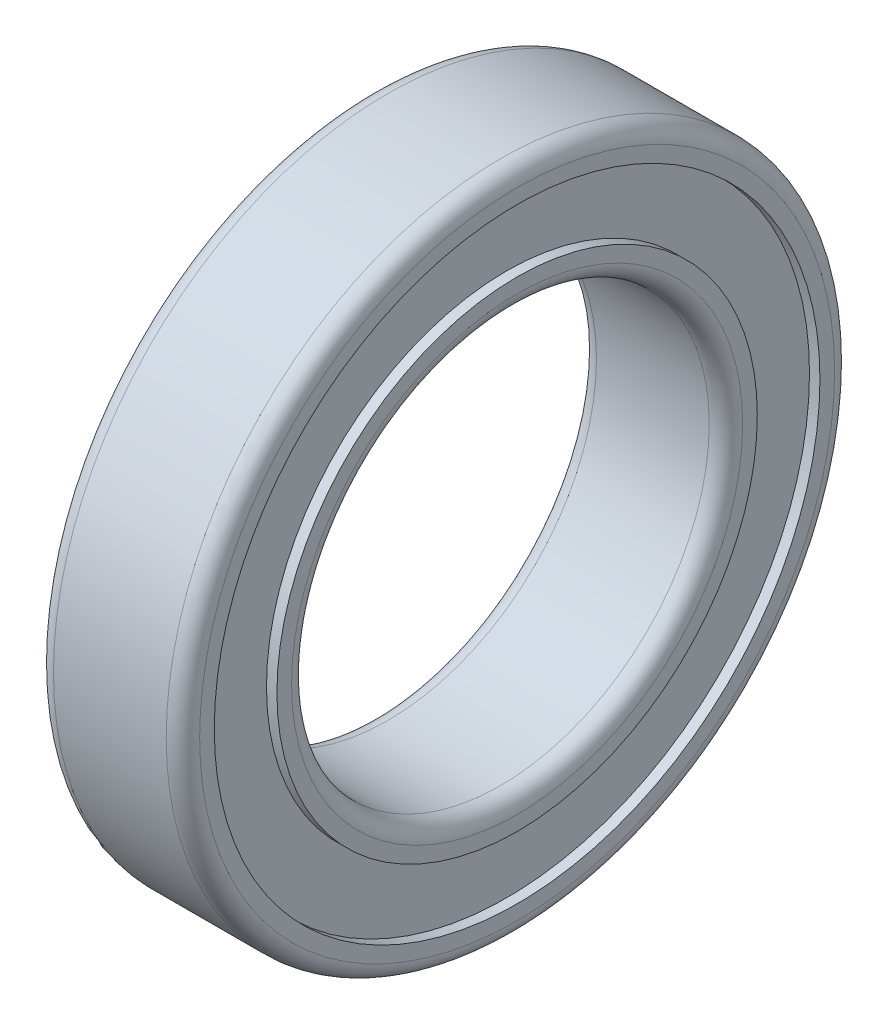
from build123d import *

# Parameters (mm, degrees)
FILLET_1_R = 0.8


with BuildPart() as part:
    # Sketch 1 → Revolve 1 (revolve)
    with BuildSketch(Plane.XY, mode=Mode.PRIVATE) as revolve_1_sk:
        Polygon((3.5, 10), (-3.5, 10), (-3.5, 11.5), (-3, 11.5), (-3, 14.5), (-3.5, 14.5), (-3.5, 16), (3.5, 16), (3.5, 14.5), (3, 14.5), (3, 11.5), (3.5, 11.5), align=None)
    revolve(revolve_1_sk.sketch.rotate(Axis((0, 0, 0), (-1, 0, 0)), 90), axis=Axis((0, 0, 0), (-1, 0, 0)))

    # Fillet 1
    fillet_1_edges = [part.edges().sort_by_distance(p)[0] for p in [
        (-3.5, 0, 16),
        (3.5, 0, 16),
        (3.5, 0, 10),
        (-3.5, 0, 10),
    ]]
    fillet(fillet_1_edges, radius=FILLET_1_R)


solid = part.part
